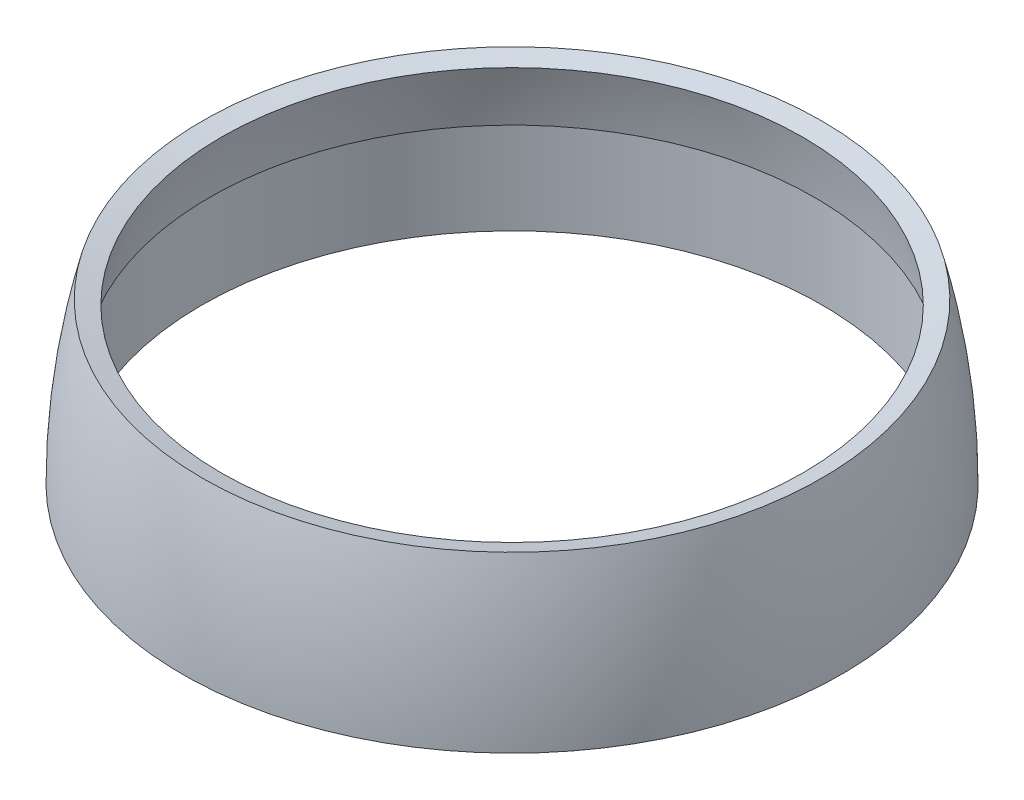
from build123d import *

# Parameters (mm, degrees)
SKETCH3_W = 16
SKETCH3_H = 5


with BuildPart() as part:
    # Sketch2 → Revolve-Thin1 (revolve)
    with BuildSketch(Plane.XY, mode=Mode.PRIVATE) as revolve_thin1_sk:
        with BuildLine():
            ThreePointArc((15, 8), (15.749030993, 4.031128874), (16, 0))
            Line((16, 0), (17, 0))
            ThreePointArc((17, 0), (16.74130887, 4.155163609), (15.969230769, 8.246153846))
            Line((15.969230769, 8.246153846), (15, 8))
        make_face()
    revolve(revolve_thin1_sk.sketch.rotate(Axis((0, 0, 0), (0, 1, 0)), 90), axis=Axis((0, 0, 0), (0, 1, 0)))

    # Sketch3 → Cut-Revolve1 (revolve, cut)
    with BuildSketch(Plane.XY, mode=Mode.PRIVATE) as cut_revolve1_sk:
        with Locations((8, 2.5)):
            Rectangle(SKETCH3_W, SKETCH3_H)
    revolve(cut_revolve1_sk.sketch.rotate(Axis((0, 5, 0), (0, -1, 0)), 270), axis=Axis((0, 5, 0), (0, -1, 0)), mode=Mode.SUBTRACT)


solid = part.part
